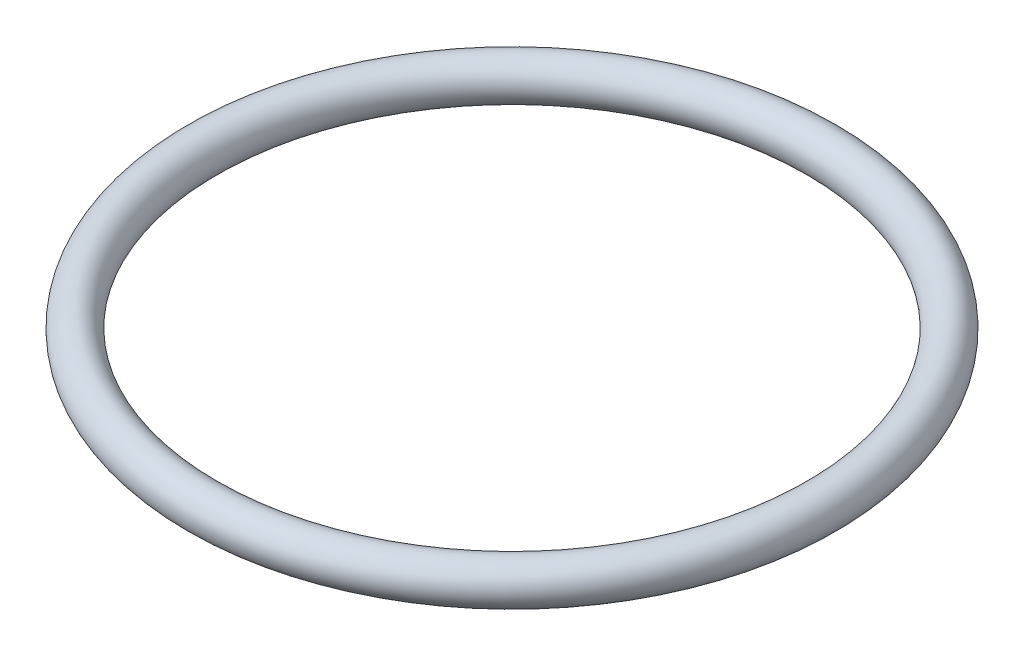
from build123d import *

# Parameters (mm, degrees)
ESQUISSE1_R = 0.89


with BuildPart() as part:
    # Esquisse1 → R_volution1 (revolve)
    with BuildSketch(Plane.XY, mode=Mode.PRIVATE) as r_volution1_sk:
        with Locations((-13.45, -0.64)):
            Circle(ESQUISSE1_R)
    revolve(r_volution1_sk.sketch.rotate(Axis((0, 0, 0), (0, -1, 0)), 270), axis=Axis((0, 0, 0), (0, -1, 0)))


solid = part.part
